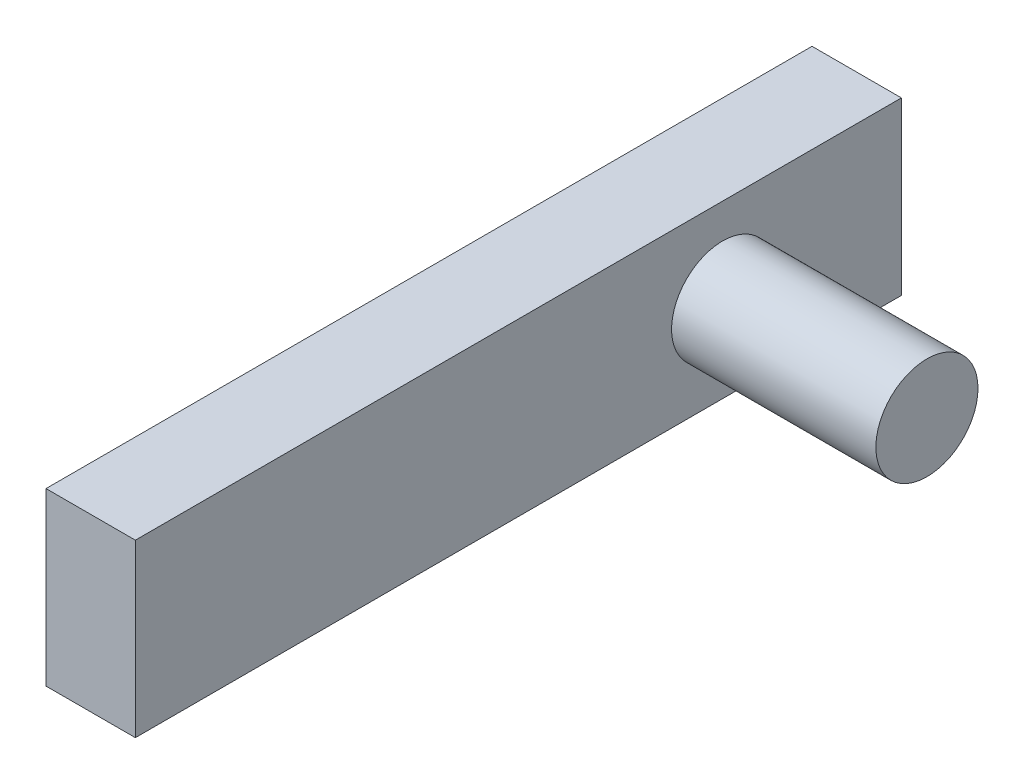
ISO-10303-21;
HEADER;
FILE_DESCRIPTION(('STEP AP214'),'2;1');
FILE_NAME('part.step','',(''),(''),'','','');
FILE_SCHEMA(('AUTOMOTIVE_DESIGN { 1 0 10303 214 1 1 1 1 }'));
ENDSEC;
DATA;
#1=APPLICATION_CONTEXT('core data for automotive mechanical design processes');
#2=APPLICATION_PROTOCOL_DEFINITION('international standard','automotive_design',2000,#1);
#3=PRODUCT_CONTEXT('',#1,'mechanical');
#4=PRODUCT('Part','Part','',(#3));
#5=PRODUCT_RELATED_PRODUCT_CATEGORY('part','',(#4));
#6=PRODUCT_DEFINITION_FORMATION('','',#4);
#7=PRODUCT_DEFINITION_CONTEXT('part definition',#1,'design');
#8=PRODUCT_DEFINITION('design','',#6,#7);
#9=PRODUCT_DEFINITION_SHAPE('','',#8);
#10=(LENGTH_UNIT() NAMED_UNIT(*) SI_UNIT(.MILLI.,.METRE.));
#11=(NAMED_UNIT(*) PLANE_ANGLE_UNIT() SI_UNIT($,.RADIAN.));
#12=(NAMED_UNIT(*) SI_UNIT($,.STERADIAN.) SOLID_ANGLE_UNIT());
#13=UNCERTAINTY_MEASURE_WITH_UNIT(LENGTH_MEASURE(1.E-05),#10,'distance_accuracy_value','');
#14=(GEOMETRIC_REPRESENTATION_CONTEXT(3) GLOBAL_UNCERTAINTY_ASSIGNED_CONTEXT((#13)) GLOBAL_UNIT_ASSIGNED_CONTEXT((#10,
#11,#12)) REPRESENTATION_CONTEXT('',''));
#15=CARTESIAN_POINT('',(0.,0.,0.));
#16=DIRECTION('',(0.,0.,1.));
#17=DIRECTION('',(1.,0.,0.));
#18=AXIS2_PLACEMENT_3D('',#15,#16,#17);
#19=CARTESIAN_POINT('',(3.5,-3.35,15.));
#20=DIRECTION('',(0.,0.,-1.));
#21=DIRECTION('',(-1.,0.,0.));
#22=AXIS2_PLACEMENT_3D('',#19,#20,#21);
#23=PLANE('',#22);
#24=DIRECTION('',(0.,-1.,0.));
#25=VECTOR('',#24,1.);
#26=CARTESIAN_POINT('',(0.,-3.35,15.));
#27=LINE('',#26,#25);
#28=CARTESIAN_POINT('',(0.,3.35,15.));
#29=VERTEX_POINT('',#28);
#30=CARTESIAN_POINT('',(0.,-3.35,15.));
#31=VERTEX_POINT('',#30);
#32=EDGE_CURVE('E100',#29,#31,#27,.T.);
#33=ORIENTED_EDGE('',*,*,#32,.T.);
#34=DIRECTION('',(-1.,0.,0.));
#35=VECTOR('',#34,1.);
#36=CARTESIAN_POINT('',(3.5,-3.35,15.));
#37=LINE('',#36,#35);
#38=CARTESIAN_POINT('',(3.5,-3.35,15.));
#39=VERTEX_POINT('',#38);
#40=EDGE_CURVE('E11',#39,#31,#37,.T.);
#41=ORIENTED_EDGE('',*,*,#40,.F.);
#42=DIRECTION('',(0.,-1.,0.));
#43=VECTOR('',#42,1.);
#44=CARTESIAN_POINT('',(3.5,-3.35,15.));
#45=LINE('',#44,#43);
#46=CARTESIAN_POINT('',(3.5,3.35,15.));
#47=VERTEX_POINT('',#46);
#48=EDGE_CURVE('E88',#47,#39,#45,.T.);
#49=ORIENTED_EDGE('',*,*,#48,.F.);
#50=DIRECTION('',(-1.,0.,0.));
#51=VECTOR('',#50,1.);
#52=CARTESIAN_POINT('',(3.5,3.35,15.));
#53=LINE('',#52,#51);
#54=EDGE_CURVE('E96',#47,#29,#53,.T.);
#55=ORIENTED_EDGE('',*,*,#54,.T.);
#56=EDGE_LOOP('',(#33,#41,#49,#55));
#57=FACE_BOUND('',#56,.T.);
#58=ADVANCED_FACE('F37',(#57),#23,.F.);
#59=CARTESIAN_POINT('',(3.5,-3.35,-15.));
#60=DIRECTION('',(0.,1.,0.));
#61=DIRECTION('',(0.,0.,1.));
#62=AXIS2_PLACEMENT_3D('',#59,#60,#61);
#63=PLANE('',#62);
#64=DIRECTION('',(0.,0.,-1.));
#65=VECTOR('',#64,1.);
#66=CARTESIAN_POINT('',(0.,-3.35,-15.));
#67=LINE('',#66,#65);
#68=CARTESIAN_POINT('',(0.,-3.35,-15.));
#69=VERTEX_POINT('',#68);
#70=EDGE_CURVE('E92',#31,#69,#67,.T.);
#71=ORIENTED_EDGE('',*,*,#70,.T.);
#72=DIRECTION('',(-1.,0.,0.));
#73=VECTOR('',#72,1.);
#74=CARTESIAN_POINT('',(3.5,-3.35,-15.));
#75=LINE('',#74,#73);
#76=CARTESIAN_POINT('',(3.5,-3.35,-15.));
#77=VERTEX_POINT('',#76);
#78=EDGE_CURVE('E45',#77,#69,#75,.T.);
#79=ORIENTED_EDGE('',*,*,#78,.F.);
#80=DIRECTION('',(0.,0.,-1.));
#81=VECTOR('',#80,1.);
#82=CARTESIAN_POINT('',(3.5,-3.35,-15.));
#83=LINE('',#82,#81);
#84=EDGE_CURVE('E83',#39,#77,#83,.T.);
#85=ORIENTED_EDGE('',*,*,#84,.F.);
#86=ORIENTED_EDGE('',*,*,#40,.T.);
#87=EDGE_LOOP('',(#71,#79,#85,#86));
#88=FACE_BOUND('',#87,.T.);
#89=ADVANCED_FACE('F91',(#88),#63,.F.);
#90=CARTESIAN_POINT('',(3.5,-3.35,-15.));
#91=DIRECTION('',(0.,0.,1.));
#92=DIRECTION('',(1.,0.,0.));
#93=AXIS2_PLACEMENT_3D('',#90,#91,#92);
#94=PLANE('',#93);
#95=DIRECTION('',(0.,1.,0.));
#96=VECTOR('',#95,1.);
#97=CARTESIAN_POINT('',(0.,-3.35,-15.));
#98=LINE('',#97,#96);
#99=CARTESIAN_POINT('',(0.,3.35,-15.));
#100=VERTEX_POINT('',#99);
#101=EDGE_CURVE('E70',#69,#100,#98,.T.);
#102=ORIENTED_EDGE('',*,*,#101,.T.);
#103=DIRECTION('',(-1.,0.,0.));
#104=VECTOR('',#103,1.);
#105=CARTESIAN_POINT('',(3.5,3.35,-15.));
#106=LINE('',#105,#104);
#107=CARTESIAN_POINT('',(3.5,3.35,-15.));
#108=VERTEX_POINT('',#107);
#109=EDGE_CURVE('E93',#108,#100,#106,.T.);
#110=ORIENTED_EDGE('',*,*,#109,.F.);
#111=DIRECTION('',(0.,1.,0.));
#112=VECTOR('',#111,1.);
#113=CARTESIAN_POINT('',(3.5,-3.35,-15.));
#114=LINE('',#113,#112);
#115=EDGE_CURVE('E86',#77,#108,#114,.T.);
#116=ORIENTED_EDGE('',*,*,#115,.F.);
#117=ORIENTED_EDGE('',*,*,#78,.T.);
#118=EDGE_LOOP('',(#102,#110,#116,#117));
#119=FACE_BOUND('',#118,.T.);
#120=ADVANCED_FACE('F94',(#119),#94,.F.);
#121=CARTESIAN_POINT('',(3.5,3.35,-15.));
#122=DIRECTION('',(0.,-1.,0.));
#123=DIRECTION('',(0.,0.,-1.));
#124=AXIS2_PLACEMENT_3D('',#121,#122,#123);
#125=PLANE('',#124);
#126=DIRECTION('',(0.,0.,1.));
#127=VECTOR('',#126,1.);
#128=CARTESIAN_POINT('',(0.,3.35,-15.));
#129=LINE('',#128,#127);
#130=EDGE_CURVE('E76',#100,#29,#129,.T.);
#131=ORIENTED_EDGE('',*,*,#130,.T.);
#132=ORIENTED_EDGE('',*,*,#54,.F.);
#133=DIRECTION('',(0.,0.,1.));
#134=VECTOR('',#133,1.);
#135=CARTESIAN_POINT('',(3.5,3.35,-15.));
#136=LINE('',#135,#134);
#137=EDGE_CURVE('E53',#108,#47,#136,.T.);
#138=ORIENTED_EDGE('',*,*,#137,.F.);
#139=ORIENTED_EDGE('',*,*,#109,.T.);
#140=EDGE_LOOP('',(#131,#132,#138,#139));
#141=FACE_BOUND('',#140,.T.);
#142=ADVANCED_FACE('F108',(#141),#125,.F.);
#143=CARTESIAN_POINT('',(3.5,0.,0.));
#144=DIRECTION('',(1.,0.,0.));
#145=DIRECTION('',(0.,0.,-1.));
#146=AXIS2_PLACEMENT_3D('',#143,#144,#145);
#147=PLANE('',#146);
#148=CARTESIAN_POINT('',(3.5,0.,-8.));
#149=DIRECTION('',(1.,0.,0.));
#150=DIRECTION('',(0.,0.,-1.));
#151=AXIS2_PLACEMENT_3D('',#148,#149,#150);
#152=CIRCLE('',#151,2.);
#153=CARTESIAN_POINT('',(3.5,0.,-10.));
#154=VERTEX_POINT('',#153);
#155=EDGE_CURVE('E114',#154,#154,#152,.T.);
#156=ORIENTED_EDGE('',*,*,#155,.F.);
#157=EDGE_LOOP('',(#156));
#158=FACE_BOUND('',#157,.T.);
#159=ORIENTED_EDGE('',*,*,#48,.T.);
#160=ORIENTED_EDGE('',*,*,#84,.T.);
#161=ORIENTED_EDGE('',*,*,#115,.T.);
#162=ORIENTED_EDGE('',*,*,#137,.T.);
#163=EDGE_LOOP('',(#159,#160,#161,#162));
#164=FACE_BOUND('',#163,.T.);
#165=ADVANCED_FACE('F84',(#158,#164),#147,.T.);
#166=CARTESIAN_POINT('',(0.,0.,0.));
#167=DIRECTION('',(1.,0.,0.));
#168=DIRECTION('',(0.,0.,-1.));
#169=AXIS2_PLACEMENT_3D('',#166,#167,#168);
#170=PLANE('',#169);
#171=ORIENTED_EDGE('',*,*,#32,.F.);
#172=ORIENTED_EDGE('',*,*,#130,.F.);
#173=ORIENTED_EDGE('',*,*,#101,.F.);
#174=ORIENTED_EDGE('',*,*,#70,.F.);
#175=EDGE_LOOP('',(#171,#172,#173,#174));
#176=FACE_BOUND('',#175,.T.);
#177=ADVANCED_FACE('F111',(#176),#170,.F.);
#178=CARTESIAN_POINT('',(11.5,0.,-8.));
#179=DIRECTION('',(-1.,0.,0.));
#180=DIRECTION('',(0.,0.,1.));
#181=AXIS2_PLACEMENT_3D('',#178,#179,#180);
#182=CYLINDRICAL_SURFACE('',#181,2.);
#183=CARTESIAN_POINT('',(11.5,0.,-8.));
#184=DIRECTION('',(1.,0.,0.));
#185=DIRECTION('',(0.,0.,-1.));
#186=AXIS2_PLACEMENT_3D('',#183,#184,#185);
#187=CIRCLE('',#186,2.);
#188=CARTESIAN_POINT('',(11.5,0.,-10.));
#189=VERTEX_POINT('',#188);
#190=EDGE_CURVE('E103',#189,#189,#187,.T.);
#191=ORIENTED_EDGE('',*,*,#190,.F.);
#192=EDGE_LOOP('',(#191));
#193=FACE_BOUND('',#192,.T.);
#194=ORIENTED_EDGE('',*,*,#155,.T.);
#195=EDGE_LOOP('',(#194));
#196=FACE_BOUND('',#195,.T.);
#197=ADVANCED_FACE('F122',(#193,#196),#182,.T.);
#198=CARTESIAN_POINT('',(11.5,0.,-8.));
#199=DIRECTION('',(1.,0.,0.));
#200=DIRECTION('',(0.,0.,-1.));
#201=AXIS2_PLACEMENT_3D('',#198,#199,#200);
#202=PLANE('',#201);
#203=ORIENTED_EDGE('',*,*,#190,.T.);
#204=EDGE_LOOP('',(#203));
#205=FACE_BOUND('',#204,.T.);
#206=ADVANCED_FACE('F120',(#205),#202,.T.);
#207=CLOSED_SHELL('',(#58,#89,#120,#142,#165,#177,#197,#206));
#208=MANIFOLD_SOLID_BREP('B2',#207);
#209=ADVANCED_BREP_SHAPE_REPRESENTATION('',(#18,#208),#14);
#210=SHAPE_DEFINITION_REPRESENTATION(#9,#209);
ENDSEC;
END-ISO-10303-21;
